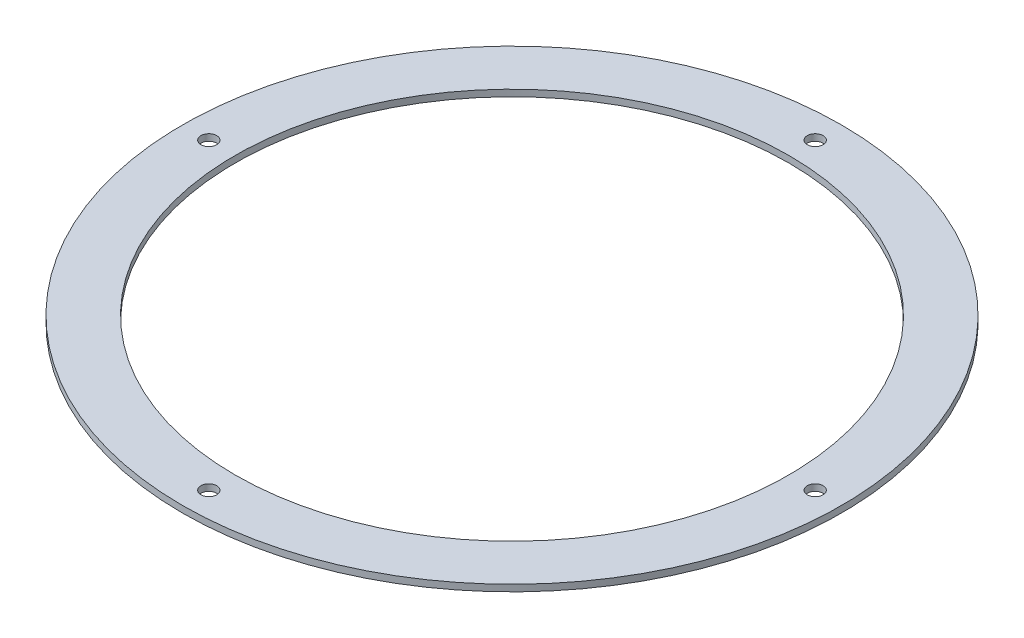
from build123d import *

# Parameters (mm, degrees)
SKETCH_1_R               = 25
SKETCH_1_R_2             = 21
EXTRUDE_1_DEPTH          = 0.5
SKETCH_2_R               = 0.6
CUT_EXTRUDE_1_DEPTH      = 36.358874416
PATTERN_CIRCULAR_1_COUNT = 4


with BuildPart() as part:
    # Sketch 1 → Extrude 1 (new body)
    with BuildSketch(Plane(origin=(0, 0, 0), x_dir=(1, 0, 0), z_dir=(0, 1, 0))):
        with Locations(Location((0, 0, 0), (0, 0, 270))):
            Circle(SKETCH_1_R)
        with Locations(Location((0, 0, 0), (0, 0, 270))):
            Circle(SKETCH_1_R_2, mode=Mode.SUBTRACT)
    extrude(amount=EXTRUDE_1_DEPTH)

    # Sketch 2 → Cut-Extrude 1 (cut, through all)
    with BuildSketch(Plane(origin=(0, 0.5, 0), x_dir=(1, 0, 0), z_dir=(0, 1, 0))):
        with Locations(Location((-23, 0, 0), (0, 0, 270))):
            Circle(SKETCH_2_R)
    cut_extrude_1 = extrude(amount=-CUT_EXTRUDE_1_DEPTH, mode=Mode.SUBTRACT)

    # Pattern Circular 1: Cut-Extrude 1 ×4 about axis
    pattern_circular_1_axis = Axis((0, 0, 0), (0, 1, 0))
    for i in range(1, PATTERN_CIRCULAR_1_COUNT):
        add(cut_extrude_1.rotate(pattern_circular_1_axis, i * 360 / PATTERN_CIRCULAR_1_COUNT), mode=Mode.SUBTRACT)


solid = part.part
